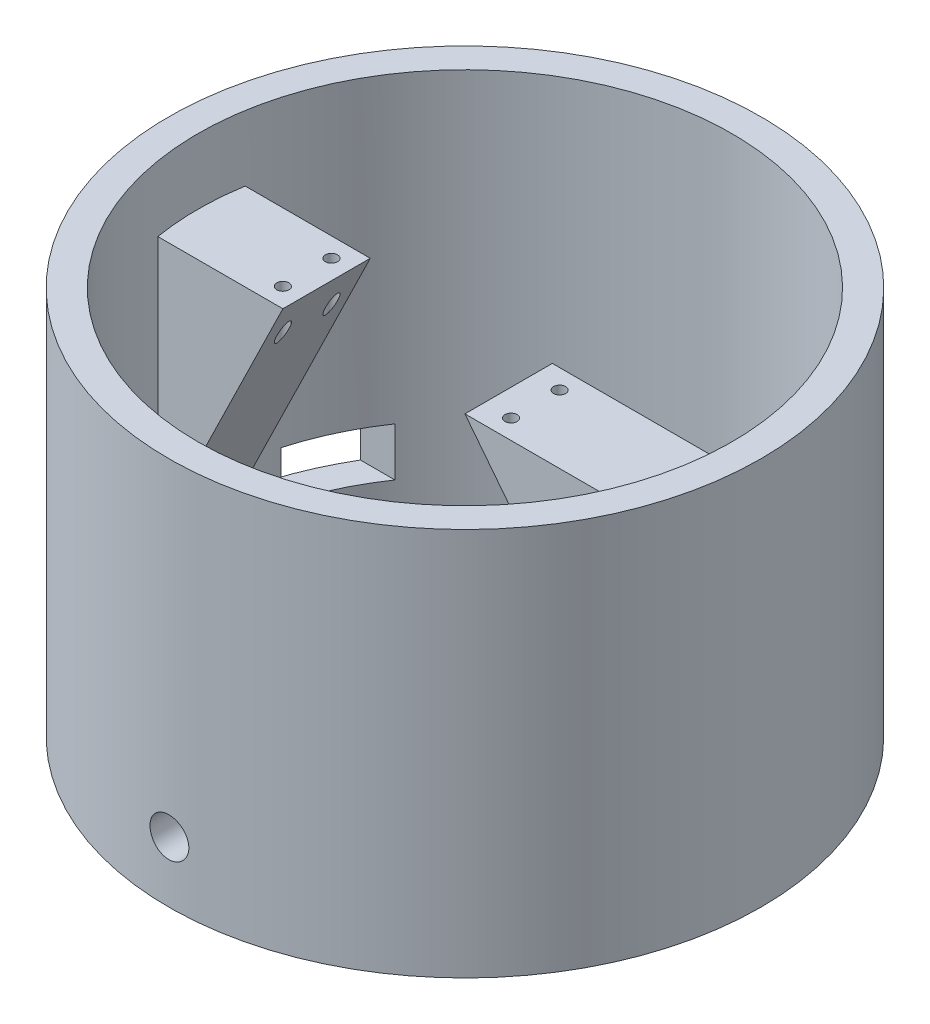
from build123d import *

# Parameters (mm, degrees)
SKETCH1_R             = 61
SKETCH1_R_2           = 55
EXTRUDE_THIN1_DEPTH   = 80
M3_TAPPED_HOLE1_D     = 2.5
M3_TAPPED_HOLE1_DEPTH = 7.5
M3_TAPPED_HOLE1_TIP   = 0.751075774
BOSS_EXTRUDE1_DEPTH   = 9
CUT_EXTRUDE1_DEPTH    = 109.923138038
SKETCH9_W             = 16
SKETCH9_H             = 10
CUT_EXTRUDE2_DEPTH    = 100
SKETCH10_R            = 4
CUT_EXTRUDE3_DEPTH    = 70
M3_TAPPED_HOLE2_D     = 2.5


with BuildPart() as part:
    # Sketch1 → Extrude-Thin1 (new body)
    with BuildSketch(Plane(origin=(0, 0, 0), x_dir=(1, 0, 0), z_dir=(0, 1, 0))):
        Circle(SKETCH1_R)
        Circle(SKETCH1_R_2, mode=Mode.SUBTRACT)
    extrude(amount=EXTRUDE_THIN1_DEPTH)

    # M3 Tapped Hole1
    with Locations(Plane(origin=(0, 0, 0), x_dir=(-1, 0, 0), z_dir=(0, -1, 0))):
        with Locations((0, -58), (-58, 0), (0, 58), (58, 0)):
            Hole(M3_TAPPED_HOLE1_D / 2, depth=M3_TAPPED_HOLE1_DEPTH)
            with Locations((0, 0, -(M3_TAPPED_HOLE1_DEPTH + M3_TAPPED_HOLE1_TIP / 2))):  # 118° drill point
                Cone(0, M3_TAPPED_HOLE1_D / 2, M3_TAPPED_HOLE1_TIP, mode=Mode.SUBTRACT)

    # Sketch4 → Boss-Extrude1 (add, symmetric)
    with BuildSketch(Plane.XY):
        Polygon((-61, 0), (-28.5, 66.5), (-61, 66.5), align=None)
        Polygon((61, 0), (9, 66.5), (61, 66.5), align=None)
    extrude(amount=BOSS_EXTRUDE1_DEPTH, both=True)

    # Sketch5 → Cut-Extrude1 (cut, through all)
    with BuildSketch(Plane(origin=(0, 66.5, 0), x_dir=(1, 0, 0), z_dir=(0, 1, 0))):
        with BuildLine():
            Line((-61, 9), (-61, 0))
            ThreePointArc((-61, 0), (-60.832874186, 4.512362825), (-60.332412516, 9))
            Line((-60.332412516, 9), (-61, 9))
        make_face()
        with BuildLine():
            Line((-61, -9), (-60.332412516, -9))
            ThreePointArc((-60.332412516, -9), (-60.832874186, -4.512362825), (-61, 0))
            Line((-61, 0), (-61, -9))
        make_face()
        with BuildLine():
            ThreePointArc((60.332412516, 9), (60.832874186, 4.512362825), (61, 0))
            Line((61, 0), (61, 9))
            Line((61, 9), (60.332412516, 9))
        make_face()
        with BuildLine():
            Line((60.332412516, -9), (61, -9))
            Line((61, -9), (61, 0))
            ThreePointArc((61, 0), (60.832874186, -4.512362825), (60.332412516, -9))
        make_face()
    extrude(amount=-CUT_EXTRUDE1_DEPTH, mode=Mode.SUBTRACT)

    # Sketch9 → Cut-Extrude2 (cut)
    with BuildSketch(Plane.ZY):
        with Locations((-23, 12.5)):
            Rectangle(SKETCH9_W, SKETCH9_H)
    extrude(amount=CUT_EXTRUDE2_DEPTH, mode=Mode.SUBTRACT)

    # Sketch10 → Cut-Extrude3 (cut)
    with BuildSketch(Plane(origin=(9, 0, 0), x_dir=(-1, 0, 0), z_dir=(0, 0, -1))):
        with Locations((9, 12.5)):
            Circle(SKETCH10_R)
    extrude(amount=-CUT_EXTRUDE3_DEPTH, mode=Mode.SUBTRACT)

    # M3 Tapped Hole2 (through all)
    with Locations(Plane(origin=(0, 66.5, 0), x_dir=(1, 0, 0), z_dir=(0, 1, 0))):
        with Locations((-32.5, 5), (-32.5, -5), (14.5, -5), (14.5, 5)):
            Hole(M3_TAPPED_HOLE2_D / 2)


solid = part.part
